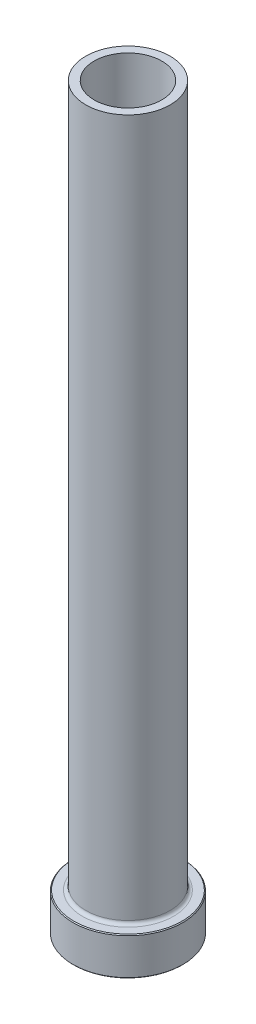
ISO-10303-21;
HEADER;
FILE_DESCRIPTION(('STEP AP214'),'2;1');
FILE_NAME('part.step','',(''),(''),'','','');
FILE_SCHEMA(('AUTOMOTIVE_DESIGN { 1 0 10303 214 1 1 1 1 }'));
ENDSEC;
DATA;
#1=APPLICATION_CONTEXT('core data for automotive mechanical design processes');
#2=APPLICATION_PROTOCOL_DEFINITION('international standard','automotive_design',2000,#1);
#3=PRODUCT_CONTEXT('',#1,'mechanical');
#4=PRODUCT('Part','Part','',(#3));
#5=PRODUCT_RELATED_PRODUCT_CATEGORY('part','',(#4));
#6=PRODUCT_DEFINITION_FORMATION('','',#4);
#7=PRODUCT_DEFINITION_CONTEXT('part definition',#1,'design');
#8=PRODUCT_DEFINITION('design','',#6,#7);
#9=PRODUCT_DEFINITION_SHAPE('','',#8);
#10=(LENGTH_UNIT() NAMED_UNIT(*) SI_UNIT(.MILLI.,.METRE.));
#11=(NAMED_UNIT(*) PLANE_ANGLE_UNIT() SI_UNIT($,.RADIAN.));
#12=(NAMED_UNIT(*) SI_UNIT($,.STERADIAN.) SOLID_ANGLE_UNIT());
#13=UNCERTAINTY_MEASURE_WITH_UNIT(LENGTH_MEASURE(1.E-05),#10,'distance_accuracy_value','');
#14=(GEOMETRIC_REPRESENTATION_CONTEXT(3) GLOBAL_UNCERTAINTY_ASSIGNED_CONTEXT((#13)) GLOBAL_UNIT_ASSIGNED_CONTEXT((#10,
#11,#12)) REPRESENTATION_CONTEXT('',''));
#15=CARTESIAN_POINT('',(0.,0.,0.));
#16=DIRECTION('',(0.,0.,1.));
#17=DIRECTION('',(1.,0.,0.));
#18=AXIS2_PLACEMENT_3D('',#15,#16,#17);
#19=CARTESIAN_POINT('',(0.,92.1876809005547,0.));
#20=DIRECTION('',(0.,1.,0.));
#21=DIRECTION('',(0.,0.,1.));
#22=AXIS2_PLACEMENT_3D('',#19,#20,#21);
#23=CYLINDRICAL_SURFACE('',#22,8.);
#24=CARTESIAN_POINT('',(0.,175.,0.));
#25=DIRECTION('',(0.,1.,0.));
#26=DIRECTION('',(0.,0.,1.));
#27=AXIS2_PLACEMENT_3D('',#24,#25,#26);
#28=CIRCLE('',#27,8.);
#29=CARTESIAN_POINT('',(0.,175.,8.));
#30=VERTEX_POINT('',#29);
#31=EDGE_CURVE('E62',#30,#30,#28,.T.);
#32=ORIENTED_EDGE('',*,*,#31,.T.);
#33=EDGE_LOOP('',(#32));
#34=FACE_BOUND('',#33,.T.);
#35=CARTESIAN_POINT('',(0.,120.,0.));
#36=DIRECTION('',(0.,1.,0.));
#37=DIRECTION('',(0.,0.,1.));
#38=AXIS2_PLACEMENT_3D('',#35,#36,#37);
#39=CIRCLE('',#38,8.);
#40=CARTESIAN_POINT('',(0.,120.,8.));
#41=VERTEX_POINT('',#40);
#42=EDGE_CURVE('E71',#41,#41,#39,.T.);
#43=ORIENTED_EDGE('',*,*,#42,.F.);
#44=EDGE_LOOP('',(#43));
#45=FACE_BOUND('',#44,.T.);
#46=ADVANCED_FACE('F30',(#34,#45),#23,.F.);
#47=CARTESIAN_POINT('',(-8.,175.,0.));
#48=DIRECTION('',(0.,1.,0.));
#49=DIRECTION('',(0.,0.,1.));
#50=AXIS2_PLACEMENT_3D('',#47,#48,#49);
#51=PLANE('',#50);
#52=CARTESIAN_POINT('',(0.,175.,0.));
#53=DIRECTION('',(0.,1.,0.));
#54=DIRECTION('',(0.,0.,1.));
#55=AXIS2_PLACEMENT_3D('',#52,#53,#54);
#56=CIRCLE('',#55,10.);
#57=CARTESIAN_POINT('',(0.,175.,10.));
#58=VERTEX_POINT('',#57);
#59=EDGE_CURVE('E65',#58,#58,#56,.T.);
#60=ORIENTED_EDGE('',*,*,#59,.T.);
#61=EDGE_LOOP('',(#60));
#62=FACE_BOUND('',#61,.T.);
#63=ORIENTED_EDGE('',*,*,#31,.F.);
#64=EDGE_LOOP('',(#63));
#65=FACE_BOUND('',#64,.T.);
#66=ADVANCED_FACE('F79',(#62,#65),#51,.T.);
#67=CARTESIAN_POINT('',(0.,92.1876809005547,0.));
#68=DIRECTION('',(0.,1.,0.));
#69=DIRECTION('',(0.,0.,1.));
#70=AXIS2_PLACEMENT_3D('',#67,#68,#69);
#71=CYLINDRICAL_SURFACE('',#70,10.);
#72=CARTESIAN_POINT('',(0.,9.8,0.));
#73=DIRECTION('',(0.,1.,0.));
#74=DIRECTION('',(0.,0.,1.));
#75=AXIS2_PLACEMENT_3D('',#72,#73,#74);
#76=CIRCLE('',#75,10.);
#77=CARTESIAN_POINT('',(0.,9.8,10.));
#78=VERTEX_POINT('',#77);
#79=EDGE_CURVE('E59',#78,#78,#76,.T.);
#80=ORIENTED_EDGE('',*,*,#79,.T.);
#81=EDGE_LOOP('',(#80));
#82=FACE_BOUND('',#81,.T.);
#83=ORIENTED_EDGE('',*,*,#59,.F.);
#84=EDGE_LOOP('',(#83));
#85=FACE_BOUND('',#84,.T.);
#86=ADVANCED_FACE('F85',(#82,#85),#71,.T.);
#87=CARTESIAN_POINT('',(-9.99999999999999,9.,0.));
#88=DIRECTION('',(0.,1.,0.));
#89=DIRECTION('',(0.,0.,1.));
#90=AXIS2_PLACEMENT_3D('',#87,#88,#89);
#91=PLANE('',#90);
#92=CARTESIAN_POINT('',(0.,9.,0.));
#93=DIRECTION('',(0.,1.,0.));
#94=DIRECTION('',(0.,0.,1.));
#95=AXIS2_PLACEMENT_3D('',#92,#93,#94);
#96=CIRCLE('',#95,12.8);
#97=CARTESIAN_POINT('',(0.,9.,12.8));
#98=VERTEX_POINT('',#97);
#99=EDGE_CURVE('E53',#98,#98,#96,.T.);
#100=ORIENTED_EDGE('',*,*,#99,.T.);
#101=EDGE_LOOP('',(#100));
#102=FACE_BOUND('',#101,.T.);
#103=CARTESIAN_POINT('',(0.,9.,0.));
#104=DIRECTION('',(0.,1.,0.));
#105=DIRECTION('',(0.,0.,1.));
#106=AXIS2_PLACEMENT_3D('',#103,#104,#105);
#107=CIRCLE('',#106,10.8);
#108=CARTESIAN_POINT('',(0.,9.,10.8));
#109=VERTEX_POINT('',#108);
#110=EDGE_CURVE('E56',#109,#109,#107,.F.);
#111=ORIENTED_EDGE('',*,*,#110,.T.);
#112=EDGE_LOOP('',(#111));
#113=FACE_BOUND('',#112,.T.);
#114=ADVANCED_FACE('F111',(#102,#113),#91,.T.);
#115=CARTESIAN_POINT('',(0.,92.1876809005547,0.));
#116=DIRECTION('',(0.,1.,0.));
#117=DIRECTION('',(0.,0.,1.));
#118=AXIS2_PLACEMENT_3D('',#115,#116,#117);
#119=CYLINDRICAL_SURFACE('',#118,13.);
#120=CARTESIAN_POINT('',(0.,8.79999999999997,0.));
#121=DIRECTION('',(0.,1.,0.));
#122=DIRECTION('',(0.,0.,1.));
#123=AXIS2_PLACEMENT_3D('',#120,#121,#122);
#124=CIRCLE('',#123,13.);
#125=CARTESIAN_POINT('',(0.,8.79999999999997,13.));
#126=VERTEX_POINT('',#125);
#127=EDGE_CURVE('E45',#126,#126,#124,.F.);
#128=ORIENTED_EDGE('',*,*,#127,.T.);
#129=EDGE_LOOP('',(#128));
#130=FACE_BOUND('',#129,.T.);
#131=CARTESIAN_POINT('',(0.,0.199999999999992,0.));
#132=DIRECTION('',(0.,-1.,0.));
#133=DIRECTION('',(0.,0.,-1.));
#134=AXIS2_PLACEMENT_3D('',#131,#132,#133);
#135=CIRCLE('',#134,13.);
#136=CARTESIAN_POINT('',(0.,0.199999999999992,-13.));
#137=VERTEX_POINT('',#136);
#138=EDGE_CURVE('E50',#137,#137,#135,.F.);
#139=ORIENTED_EDGE('',*,*,#138,.T.);
#140=EDGE_LOOP('',(#139));
#141=FACE_BOUND('',#140,.T.);
#142=ADVANCED_FACE('F108',(#130,#141),#119,.T.);
#143=CARTESIAN_POINT('',(-13.,0.,0.));
#144=DIRECTION('',(0.,-1.,0.));
#145=DIRECTION('',(0.,0.,-1.));
#146=AXIS2_PLACEMENT_3D('',#143,#144,#145);
#147=PLANE('',#146);
#148=CARTESIAN_POINT('',(0.,0.,0.));
#149=DIRECTION('',(0.,-1.,0.));
#150=DIRECTION('',(0.,0.,-1.));
#151=AXIS2_PLACEMENT_3D('',#148,#149,#150);
#152=CIRCLE('',#151,8.74999999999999);
#153=CARTESIAN_POINT('',(0.,0.,-8.74999999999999));
#154=VERTEX_POINT('',#153);
#155=EDGE_CURVE('E37',#154,#154,#152,.F.);
#156=ORIENTED_EDGE('',*,*,#155,.T.);
#157=EDGE_LOOP('',(#156));
#158=FACE_BOUND('',#157,.T.);
#159=CARTESIAN_POINT('',(0.,0.,0.));
#160=DIRECTION('',(0.,-1.,0.));
#161=DIRECTION('',(0.,0.,-1.));
#162=AXIS2_PLACEMENT_3D('',#159,#160,#161);
#163=CIRCLE('',#162,12.8);
#164=CARTESIAN_POINT('',(0.,0.,-12.8));
#165=VERTEX_POINT('',#164);
#166=EDGE_CURVE('E41',#165,#165,#163,.T.);
#167=ORIENTED_EDGE('',*,*,#166,.T.);
#168=EDGE_LOOP('',(#167));
#169=FACE_BOUND('',#168,.T.);
#170=ADVANCED_FACE('F110',(#158,#169),#147,.T.);
#171=CARTESIAN_POINT('',(0.,92.1876809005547,0.));
#172=DIRECTION('',(0.,1.,0.));
#173=DIRECTION('',(0.,0.,1.));
#174=AXIS2_PLACEMENT_3D('',#171,#172,#173);
#175=CYLINDRICAL_SURFACE('',#174,8.25);
#176=CARTESIAN_POINT('',(0.,0.500000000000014,0.));
#177=DIRECTION('',(0.,-1.,0.));
#178=DIRECTION('',(0.,0.,-1.));
#179=AXIS2_PLACEMENT_3D('',#176,#177,#178);
#180=CIRCLE('',#179,8.25);
#181=CARTESIAN_POINT('',(0.,0.500000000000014,-8.25));
#182=VERTEX_POINT('',#181);
#183=EDGE_CURVE('E10',#182,#182,#180,.T.);
#184=ORIENTED_EDGE('',*,*,#183,.T.);
#185=EDGE_LOOP('',(#184));
#186=FACE_BOUND('',#185,.T.);
#187=CARTESIAN_POINT('',(0.,108.,0.));
#188=DIRECTION('',(0.,1.,0.));
#189=DIRECTION('',(0.,0.,1.));
#190=AXIS2_PLACEMENT_3D('',#187,#188,#189);
#191=CIRCLE('',#190,8.25);
#192=CARTESIAN_POINT('',(0.,108.,8.25));
#193=VERTEX_POINT('',#192);
#194=EDGE_CURVE('E68',#193,#193,#191,.T.);
#195=ORIENTED_EDGE('',*,*,#194,.T.);
#196=EDGE_LOOP('',(#195));
#197=FACE_BOUND('',#196,.T.);
#198=ADVANCED_FACE('F118',(#186,#197),#175,.F.);
#199=CARTESIAN_POINT('',(0.,108.,0.));
#200=DIRECTION('',(0.,-1.,0.));
#201=DIRECTION('',(0.,0.,-1.));
#202=AXIS2_PLACEMENT_3D('',#199,#200,#201);
#203=CONICAL_SURFACE('',#202,8.25,0.0208303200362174);
#204=ORIENTED_EDGE('',*,*,#42,.T.);
#205=EDGE_LOOP('',(#204));
#206=FACE_BOUND('',#205,.T.);
#207=ORIENTED_EDGE('',*,*,#194,.F.);
#208=EDGE_LOOP('',(#207));
#209=FACE_BOUND('',#208,.T.);
#210=ADVANCED_FACE('F75',(#206,#209),#203,.F.);
#211=CARTESIAN_POINT('',(0.,9.8,0.));
#212=DIRECTION('',(0.,1.,0.));
#213=DIRECTION('',(0.,0.,1.));
#214=AXIS2_PLACEMENT_3D('',#211,#212,#213);
#215=TOROIDAL_SURFACE('',#214,10.8,0.8);
#216=ORIENTED_EDGE('',*,*,#110,.F.);
#217=EDGE_LOOP('',(#216));
#218=FACE_BOUND('',#217,.T.);
#219=ORIENTED_EDGE('',*,*,#79,.F.);
#220=EDGE_LOOP('',(#219));
#221=FACE_BOUND('',#220,.T.);
#222=ADVANCED_FACE('F90',(#218,#221),#215,.F.);
#223=CARTESIAN_POINT('',(0.,8.99999999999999,0.));
#224=DIRECTION('',(0.,-1.,0.));
#225=DIRECTION('',(0.,0.,-1.));
#226=AXIS2_PLACEMENT_3D('',#223,#224,#225);
#227=CONICAL_SURFACE('',#226,12.8,0.785398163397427);
#228=ORIENTED_EDGE('',*,*,#127,.F.);
#229=EDGE_LOOP('',(#228));
#230=FACE_BOUND('',#229,.T.);
#231=ORIENTED_EDGE('',*,*,#99,.F.);
#232=EDGE_LOOP('',(#231));
#233=FACE_BOUND('',#232,.T.);
#234=ADVANCED_FACE('F93',(#230,#233),#227,.T.);
#235=CARTESIAN_POINT('',(0.,0.199999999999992,0.));
#236=DIRECTION('',(0.,1.,0.));
#237=DIRECTION('',(0.,0.,1.));
#238=AXIS2_PLACEMENT_3D('',#235,#236,#237);
#239=CONICAL_SURFACE('',#238,13.,0.785398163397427);
#240=ORIENTED_EDGE('',*,*,#166,.F.);
#241=EDGE_LOOP('',(#240));
#242=FACE_BOUND('',#241,.T.);
#243=ORIENTED_EDGE('',*,*,#138,.F.);
#244=EDGE_LOOP('',(#243));
#245=FACE_BOUND('',#244,.T.);
#246=ADVANCED_FACE('F96',(#242,#245),#239,.T.);
#247=CARTESIAN_POINT('',(0.,0.,0.));
#248=DIRECTION('',(0.,-1.,0.));
#249=DIRECTION('',(0.,0.,-1.));
#250=AXIS2_PLACEMENT_3D('',#247,#248,#249);
#251=CONICAL_SURFACE('',#250,8.74999999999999,0.785398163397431);
#252=ORIENTED_EDGE('',*,*,#183,.F.);
#253=EDGE_LOOP('',(#252));
#254=FACE_BOUND('',#253,.T.);
#255=ORIENTED_EDGE('',*,*,#155,.F.);
#256=EDGE_LOOP('',(#255));
#257=FACE_BOUND('',#256,.T.);
#258=ADVANCED_FACE('F32',(#254,#257),#251,.F.);
#259=CLOSED_SHELL('',(#46,#66,#86,#114,#142,#170,#198,#210,#222,#234,#246,#258));
#260=MANIFOLD_SOLID_BREP('B2',#259);
#261=ADVANCED_BREP_SHAPE_REPRESENTATION('',(#18,#260),#14);
#262=SHAPE_DEFINITION_REPRESENTATION(#9,#261);
ENDSEC;
END-ISO-10303-21;
